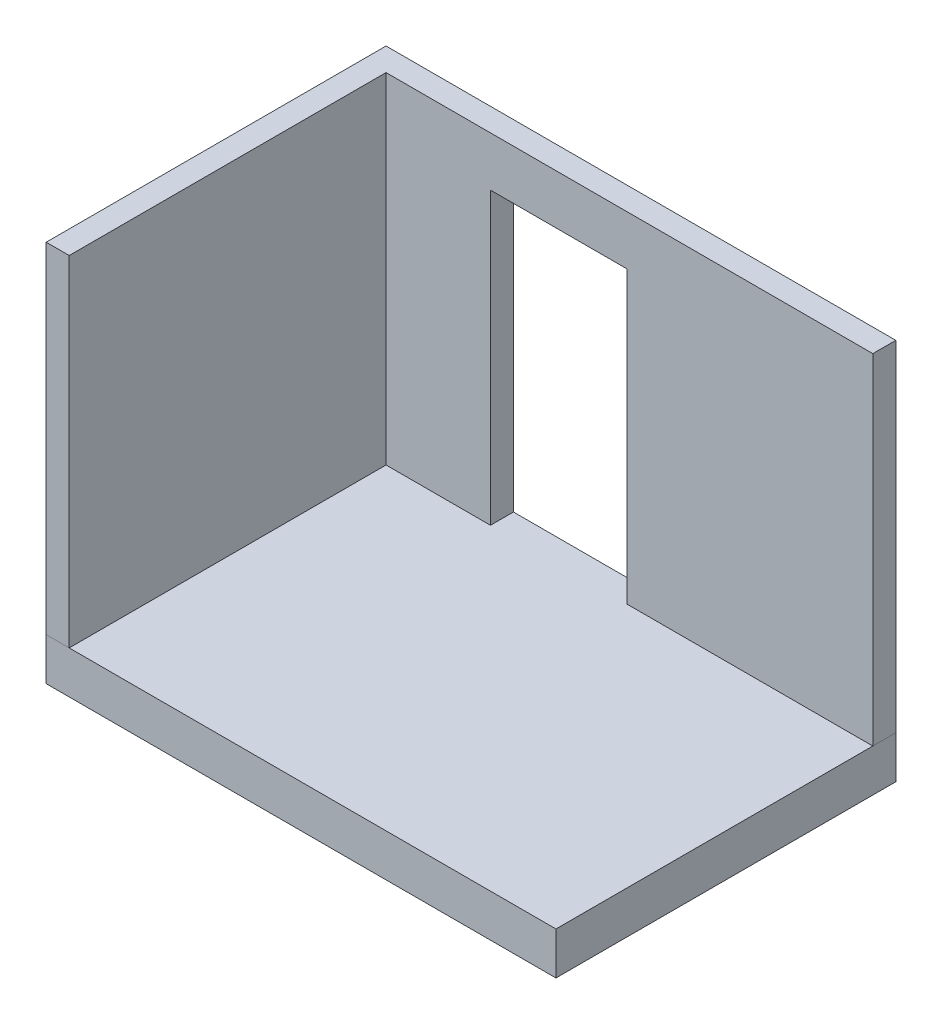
ISO-10303-21;
HEADER;
FILE_DESCRIPTION(('STEP AP214'),'2;1');
FILE_NAME('part.step','',(''),(''),'','','');
FILE_SCHEMA(('AUTOMOTIVE_DESIGN { 1 0 10303 214 1 1 1 1 }'));
ENDSEC;
DATA;
#1=APPLICATION_CONTEXT('core data for automotive mechanical design processes');
#2=APPLICATION_PROTOCOL_DEFINITION('international standard','automotive_design',2000,#1);
#3=PRODUCT_CONTEXT('',#1,'mechanical');
#4=PRODUCT('Part','Part','',(#3));
#5=PRODUCT_RELATED_PRODUCT_CATEGORY('part','',(#4));
#6=PRODUCT_DEFINITION_FORMATION('','',#4);
#7=PRODUCT_DEFINITION_CONTEXT('part definition',#1,'design');
#8=PRODUCT_DEFINITION('design','',#6,#7);
#9=PRODUCT_DEFINITION_SHAPE('','',#8);
#10=(LENGTH_UNIT() NAMED_UNIT(*) SI_UNIT(.MILLI.,.METRE.));
#11=(NAMED_UNIT(*) PLANE_ANGLE_UNIT() SI_UNIT($,.RADIAN.));
#12=(NAMED_UNIT(*) SI_UNIT($,.STERADIAN.) SOLID_ANGLE_UNIT());
#13=UNCERTAINTY_MEASURE_WITH_UNIT(LENGTH_MEASURE(1.E-05),#10,'distance_accuracy_value','');
#14=(GEOMETRIC_REPRESENTATION_CONTEXT(3) GLOBAL_UNCERTAINTY_ASSIGNED_CONTEXT((#13)) GLOBAL_UNIT_ASSIGNED_CONTEXT((#10,
#11,#12)) REPRESENTATION_CONTEXT('',''));
#15=CARTESIAN_POINT('',(0.,0.,0.));
#16=DIRECTION('',(0.,0.,1.));
#17=DIRECTION('',(1.,0.,0.));
#18=AXIS2_PLACEMENT_3D('',#15,#16,#17);
#19=CARTESIAN_POINT('',(0.,0.,0.));
#20=DIRECTION('',(0.,1.,0.));
#21=DIRECTION('',(0.,0.,1.));
#22=AXIS2_PLACEMENT_3D('',#19,#20,#21);
#23=PLANE('',#22);
#24=DIRECTION('',(1.,0.,0.));
#25=VECTOR('',#24,1.);
#26=CARTESIAN_POINT('',(3657.6,0.,165.1));
#27=LINE('',#26,#25);
#28=CARTESIAN_POINT('',(1892.3,0.,165.100000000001));
#29=VERTEX_POINT('',#28);
#30=CARTESIAN_POINT('',(3657.6,0.,165.1));
#31=VERTEX_POINT('',#30);
#32=EDGE_CURVE('E152',#29,#31,#27,.T.);
#33=ORIENTED_EDGE('',*,*,#32,.F.);
#34=DIRECTION('',(0.,0.,-1.));
#35=VECTOR('',#34,1.);
#36=CARTESIAN_POINT('',(1892.3,0.,0.));
#37=LINE('',#36,#35);
#38=CARTESIAN_POINT('',(1892.3,0.,0.));
#39=VERTEX_POINT('',#38);
#40=EDGE_CURVE('E53',#29,#39,#37,.T.);
#41=ORIENTED_EDGE('',*,*,#40,.T.);
#42=DIRECTION('',(-1.,0.,0.));
#43=VECTOR('',#42,1.);
#44=CARTESIAN_POINT('',(3657.6,0.,0.));
#45=LINE('',#44,#43);
#46=CARTESIAN_POINT('',(3657.6,0.,0.));
#47=VERTEX_POINT('',#46);
#48=EDGE_CURVE('E143',#47,#39,#45,.T.);
#49=ORIENTED_EDGE('',*,*,#48,.F.);
#50=DIRECTION('',(0.,0.,-1.));
#51=VECTOR('',#50,1.);
#52=CARTESIAN_POINT('',(3657.6,0.,165.1));
#53=LINE('',#52,#51);
#54=EDGE_CURVE('E96',#31,#47,#53,.T.);
#55=ORIENTED_EDGE('',*,*,#54,.F.);
#56=EDGE_LOOP('',(#33,#41,#49,#55));
#57=FACE_BOUND('',#56,.T.);
#58=ADVANCED_FACE('F45',(#57),#23,.F.);
#59=CARTESIAN_POINT('',(3657.6,2438.4,0.));
#60=DIRECTION('',(0.,0.,1.));
#61=DIRECTION('',(1.,0.,0.));
#62=AXIS2_PLACEMENT_3D('',#59,#60,#61);
#63=PLANE('',#62);
#64=ORIENTED_EDGE('',*,*,#48,.T.);
#65=DIRECTION('',(0.,-1.,0.));
#66=VECTOR('',#65,1.);
#67=CARTESIAN_POINT('',(1892.3,0.,0.));
#68=LINE('',#67,#66);
#69=CARTESIAN_POINT('',(1892.3,2082.8,0.));
#70=VERTEX_POINT('',#69);
#71=EDGE_CURVE('E182',#70,#39,#68,.T.);
#72=ORIENTED_EDGE('',*,*,#71,.F.);
#73=DIRECTION('',(1.,0.,0.));
#74=VECTOR('',#73,1.);
#75=CARTESIAN_POINT('',(1892.3,2082.8,0.));
#76=LINE('',#75,#74);
#77=CARTESIAN_POINT('',(914.4,2082.8,0.));
#78=VERTEX_POINT('',#77);
#79=EDGE_CURVE('E237',#78,#70,#76,.T.);
#80=ORIENTED_EDGE('',*,*,#79,.F.);
#81=DIRECTION('',(0.,1.,0.));
#82=VECTOR('',#81,1.);
#83=CARTESIAN_POINT('',(914.4,0.,0.));
#84=LINE('',#83,#82);
#85=CARTESIAN_POINT('',(914.4,0.,0.));
#86=VERTEX_POINT('',#85);
#87=EDGE_CURVE('E238',#86,#78,#84,.T.);
#88=ORIENTED_EDGE('',*,*,#87,.F.);
#89=CARTESIAN_POINT('',(0.,0.,0.));
#90=VERTEX_POINT('',#89);
#91=EDGE_CURVE('E147',#86,#90,#45,.T.);
#92=ORIENTED_EDGE('',*,*,#91,.T.);
#93=DIRECTION('',(0.,-1.,0.));
#94=VECTOR('',#93,1.);
#95=CARTESIAN_POINT('',(0.,2438.4,0.));
#96=LINE('',#95,#94);
#97=CARTESIAN_POINT('',(0.,2438.4,0.));
#98=VERTEX_POINT('',#97);
#99=EDGE_CURVE('E163',#98,#90,#96,.T.);
#100=ORIENTED_EDGE('',*,*,#99,.F.);
#101=DIRECTION('',(-1.,0.,0.));
#102=VECTOR('',#101,1.);
#103=CARTESIAN_POINT('',(3657.6,2438.4,0.));
#104=LINE('',#103,#102);
#105=CARTESIAN_POINT('',(3657.6,2438.4,0.));
#106=VERTEX_POINT('',#105);
#107=EDGE_CURVE('E156',#106,#98,#104,.T.);
#108=ORIENTED_EDGE('',*,*,#107,.F.);
#109=DIRECTION('',(0.,-1.,0.));
#110=VECTOR('',#109,1.);
#111=CARTESIAN_POINT('',(3657.6,2438.4,0.));
#112=LINE('',#111,#110);
#113=EDGE_CURVE('E139',#106,#47,#112,.T.);
#114=ORIENTED_EDGE('',*,*,#113,.T.);
#115=EDGE_LOOP('',(#64,#72,#80,#88,#92,#100,#108,#114));
#116=FACE_BOUND('',#115,.T.);
#117=ADVANCED_FACE('F47',(#116),#63,.F.);
#118=CARTESIAN_POINT('',(0.,2438.4,0.));
#119=DIRECTION('',(1.,0.,0.));
#120=DIRECTION('',(0.,0.,-1.));
#121=AXIS2_PLACEMENT_3D('',#118,#119,#120);
#122=PLANE('',#121);
#123=DIRECTION('',(0.,0.,1.));
#124=VECTOR('',#123,1.);
#125=CARTESIAN_POINT('',(0.,0.,0.));
#126=LINE('',#125,#124);
#127=CARTESIAN_POINT('',(2.98617875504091E-13,0.,2438.4));
#128=VERTEX_POINT('',#127);
#129=EDGE_CURVE('E146',#90,#128,#126,.T.);
#130=ORIENTED_EDGE('',*,*,#129,.T.);
#131=DIRECTION('',(0.,-1.,0.));
#132=VECTOR('',#131,1.);
#133=CARTESIAN_POINT('',(2.98617875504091E-13,2438.4,2438.4));
#134=LINE('',#133,#132);
#135=CARTESIAN_POINT('',(2.98617875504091E-13,2438.4,2438.4));
#136=VERTEX_POINT('',#135);
#137=EDGE_CURVE('E160',#136,#128,#134,.T.);
#138=ORIENTED_EDGE('',*,*,#137,.F.);
#139=DIRECTION('',(0.,0.,1.));
#140=VECTOR('',#139,1.);
#141=CARTESIAN_POINT('',(0.,2438.4,0.));
#142=LINE('',#141,#140);
#143=EDGE_CURVE('E105',#98,#136,#142,.T.);
#144=ORIENTED_EDGE('',*,*,#143,.F.);
#145=ORIENTED_EDGE('',*,*,#99,.T.);
#146=EDGE_LOOP('',(#130,#138,#144,#145));
#147=FACE_BOUND('',#146,.T.);
#148=ADVANCED_FACE('F200',(#147),#122,.F.);
#149=CARTESIAN_POINT('',(2.98617875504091E-13,2438.4,2438.4));
#150=DIRECTION('',(0.,0.,-1.));
#151=DIRECTION('',(-1.,0.,0.));
#152=AXIS2_PLACEMENT_3D('',#149,#150,#151);
#153=PLANE('',#152);
#154=DIRECTION('',(1.,0.,0.));
#155=VECTOR('',#154,1.);
#156=CARTESIAN_POINT('',(2.98617875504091E-13,0.,2438.4));
#157=LINE('',#156,#155);
#158=CARTESIAN_POINT('',(165.1,0.,2438.4));
#159=VERTEX_POINT('',#158);
#160=EDGE_CURVE('E149',#128,#159,#157,.T.);
#161=ORIENTED_EDGE('',*,*,#160,.T.);
#162=DIRECTION('',(0.,-1.,0.));
#163=VECTOR('',#162,1.);
#164=CARTESIAN_POINT('',(165.1,2438.4,2438.4));
#165=LINE('',#164,#163);
#166=CARTESIAN_POINT('',(165.1,2438.4,2438.4));
#167=VERTEX_POINT('',#166);
#168=EDGE_CURVE('E134',#167,#159,#165,.T.);
#169=ORIENTED_EDGE('',*,*,#168,.F.);
#170=DIRECTION('',(1.,0.,0.));
#171=VECTOR('',#170,1.);
#172=CARTESIAN_POINT('',(2.98617875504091E-13,2438.4,2438.4));
#173=LINE('',#172,#171);
#174=EDGE_CURVE('E121',#136,#167,#173,.T.);
#175=ORIENTED_EDGE('',*,*,#174,.F.);
#176=ORIENTED_EDGE('',*,*,#137,.T.);
#177=EDGE_LOOP('',(#161,#169,#175,#176));
#178=FACE_BOUND('',#177,.T.);
#179=ADVANCED_FACE('F224',(#178),#153,.F.);
#180=CARTESIAN_POINT('',(165.1,2438.4,165.1));
#181=DIRECTION('',(-1.,0.,0.));
#182=DIRECTION('',(0.,0.,1.));
#183=AXIS2_PLACEMENT_3D('',#180,#181,#182);
#184=PLANE('',#183);
#185=DIRECTION('',(0.,0.,-1.));
#186=VECTOR('',#185,1.);
#187=CARTESIAN_POINT('',(165.1,0.,165.1));
#188=LINE('',#187,#186);
#189=CARTESIAN_POINT('',(165.1,0.,165.1));
#190=VERTEX_POINT('',#189);
#191=EDGE_CURVE('E130',#159,#190,#188,.T.);
#192=ORIENTED_EDGE('',*,*,#191,.T.);
#193=DIRECTION('',(0.,-1.,0.));
#194=VECTOR('',#193,1.);
#195=CARTESIAN_POINT('',(165.1,2438.4,165.1));
#196=LINE('',#195,#194);
#197=CARTESIAN_POINT('',(165.1,2438.4,165.1));
#198=VERTEX_POINT('',#197);
#199=EDGE_CURVE('E127',#198,#190,#196,.T.);
#200=ORIENTED_EDGE('',*,*,#199,.F.);
#201=DIRECTION('',(0.,0.,-1.));
#202=VECTOR('',#201,1.);
#203=CARTESIAN_POINT('',(165.1,2438.4,165.1));
#204=LINE('',#203,#202);
#205=EDGE_CURVE('E114',#167,#198,#204,.T.);
#206=ORIENTED_EDGE('',*,*,#205,.F.);
#207=ORIENTED_EDGE('',*,*,#168,.T.);
#208=EDGE_LOOP('',(#192,#200,#206,#207));
#209=FACE_BOUND('',#208,.T.);
#210=ADVANCED_FACE('F128',(#209),#184,.F.);
#211=CARTESIAN_POINT('',(3657.6,2438.4,165.1));
#212=DIRECTION('',(0.,0.,-1.));
#213=DIRECTION('',(-1.,0.,0.));
#214=AXIS2_PLACEMENT_3D('',#211,#212,#213);
#215=PLANE('',#214);
#216=DIRECTION('',(1.,0.,0.));
#217=VECTOR('',#216,1.);
#218=CARTESIAN_POINT('',(3657.6,2082.8,165.1));
#219=LINE('',#218,#217);
#220=CARTESIAN_POINT('',(914.4,2082.8,165.100000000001));
#221=VERTEX_POINT('',#220);
#222=CARTESIAN_POINT('',(1892.3,2082.8,165.100000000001));
#223=VERTEX_POINT('',#222);
#224=EDGE_CURVE('E12',#221,#223,#219,.T.);
#225=ORIENTED_EDGE('',*,*,#224,.T.);
#226=DIRECTION('',(0.,-1.,0.));
#227=VECTOR('',#226,1.);
#228=CARTESIAN_POINT('',(1892.3,2438.4,165.1));
#229=LINE('',#228,#227);
#230=EDGE_CURVE('E216',#223,#29,#229,.T.);
#231=ORIENTED_EDGE('',*,*,#230,.T.);
#232=ORIENTED_EDGE('',*,*,#32,.T.);
#233=DIRECTION('',(0.,-1.,0.));
#234=VECTOR('',#233,1.);
#235=CARTESIAN_POINT('',(3657.6,2438.4,165.1));
#236=LINE('',#235,#234);
#237=CARTESIAN_POINT('',(3657.6,2438.4,165.1));
#238=VERTEX_POINT('',#237);
#239=EDGE_CURVE('E135',#238,#31,#236,.T.);
#240=ORIENTED_EDGE('',*,*,#239,.F.);
#241=DIRECTION('',(1.,0.,0.));
#242=VECTOR('',#241,1.);
#243=CARTESIAN_POINT('',(3657.6,2438.4,165.1));
#244=LINE('',#243,#242);
#245=EDGE_CURVE('E118',#198,#238,#244,.T.);
#246=ORIENTED_EDGE('',*,*,#245,.F.);
#247=ORIENTED_EDGE('',*,*,#199,.T.);
#248=CARTESIAN_POINT('',(914.4,0.,165.1));
#249=VERTEX_POINT('',#248);
#250=EDGE_CURVE('E153',#190,#249,#27,.T.);
#251=ORIENTED_EDGE('',*,*,#250,.T.);
#252=DIRECTION('',(0.,1.,0.));
#253=VECTOR('',#252,1.);
#254=CARTESIAN_POINT('',(914.400000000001,2438.4,165.1));
#255=LINE('',#254,#253);
#256=EDGE_CURVE('E60',#249,#221,#255,.T.);
#257=ORIENTED_EDGE('',*,*,#256,.T.);
#258=EDGE_LOOP('',(#225,#231,#232,#240,#246,#247,#251,#257));
#259=FACE_BOUND('',#258,.T.);
#260=ADVANCED_FACE('F137',(#259),#215,.F.);
#261=CARTESIAN_POINT('',(3657.6,2438.4,165.1));
#262=DIRECTION('',(-1.,0.,0.));
#263=DIRECTION('',(0.,0.,1.));
#264=AXIS2_PLACEMENT_3D('',#261,#262,#263);
#265=PLANE('',#264);
#266=ORIENTED_EDGE('',*,*,#54,.T.);
#267=ORIENTED_EDGE('',*,*,#113,.F.);
#268=DIRECTION('',(0.,0.,-1.));
#269=VECTOR('',#268,1.);
#270=CARTESIAN_POINT('',(3657.6,2438.4,165.1));
#271=LINE('',#270,#269);
#272=EDGE_CURVE('E69',#238,#106,#271,.T.);
#273=ORIENTED_EDGE('',*,*,#272,.F.);
#274=ORIENTED_EDGE('',*,*,#239,.T.);
#275=EDGE_LOOP('',(#266,#267,#273,#274));
#276=FACE_BOUND('',#275,.T.);
#277=ADVANCED_FACE('F185',(#276),#265,.F.);
#278=CARTESIAN_POINT('',(0.,2438.4,0.));
#279=DIRECTION('',(0.,1.,0.));
#280=DIRECTION('',(0.,0.,1.));
#281=AXIS2_PLACEMENT_3D('',#278,#279,#280);
#282=PLANE('',#281);
#283=ORIENTED_EDGE('',*,*,#107,.T.);
#284=ORIENTED_EDGE('',*,*,#143,.T.);
#285=ORIENTED_EDGE('',*,*,#174,.T.);
#286=ORIENTED_EDGE('',*,*,#205,.T.);
#287=ORIENTED_EDGE('',*,*,#245,.T.);
#288=ORIENTED_EDGE('',*,*,#272,.T.);
#289=EDGE_LOOP('',(#283,#284,#285,#286,#287,#288));
#290=FACE_BOUND('',#289,.T.);
#291=ADVANCED_FACE('F116',(#290),#282,.T.);
#292=ORIENTED_EDGE('',*,*,#91,.F.);
#293=DIRECTION('',(0.,0.,1.));
#294=VECTOR('',#293,1.);
#295=CARTESIAN_POINT('',(914.4,0.,0.));
#296=LINE('',#295,#294);
#297=EDGE_CURVE('E165',#86,#249,#296,.T.);
#298=ORIENTED_EDGE('',*,*,#297,.T.);
#299=ORIENTED_EDGE('',*,*,#250,.F.);
#300=ORIENTED_EDGE('',*,*,#191,.F.);
#301=ORIENTED_EDGE('',*,*,#160,.F.);
#302=ORIENTED_EDGE('',*,*,#129,.F.);
#303=EDGE_LOOP('',(#292,#298,#299,#300,#301,#302));
#304=FACE_BOUND('',#303,.T.);
#305=ADVANCED_FACE('F192',(#304),#23,.F.);
#306=CARTESIAN_POINT('',(1892.3,2082.8,2438.4));
#307=DIRECTION('',(0.,1.,0.));
#308=DIRECTION('',(0.,0.,1.));
#309=AXIS2_PLACEMENT_3D('',#306,#307,#308);
#310=PLANE('',#309);
#311=DIRECTION('',(0.,0.,-1.));
#312=VECTOR('',#311,1.);
#313=CARTESIAN_POINT('',(914.4,2082.8,2438.4));
#314=LINE('',#313,#312);
#315=EDGE_CURVE('E235',#221,#78,#314,.T.);
#316=ORIENTED_EDGE('',*,*,#315,.T.);
#317=ORIENTED_EDGE('',*,*,#79,.T.);
#318=DIRECTION('',(0.,0.,-1.));
#319=VECTOR('',#318,1.);
#320=CARTESIAN_POINT('',(1892.3,2082.8,2438.4));
#321=LINE('',#320,#319);
#322=EDGE_CURVE('E218',#223,#70,#321,.T.);
#323=ORIENTED_EDGE('',*,*,#322,.F.);
#324=ORIENTED_EDGE('',*,*,#224,.F.);
#325=EDGE_LOOP('',(#316,#317,#323,#324));
#326=FACE_BOUND('',#325,.T.);
#327=ADVANCED_FACE('F202',(#326),#310,.F.);
#328=CARTESIAN_POINT('',(1892.3,0.,2438.4));
#329=DIRECTION('',(1.,0.,0.));
#330=DIRECTION('',(0.,0.,-1.));
#331=AXIS2_PLACEMENT_3D('',#328,#329,#330);
#332=PLANE('',#331);
#333=ORIENTED_EDGE('',*,*,#322,.T.);
#334=ORIENTED_EDGE('',*,*,#71,.T.);
#335=ORIENTED_EDGE('',*,*,#40,.F.);
#336=ORIENTED_EDGE('',*,*,#230,.F.);
#337=EDGE_LOOP('',(#333,#334,#335,#336));
#338=FACE_BOUND('',#337,.T.);
#339=ADVANCED_FACE('F207',(#338),#332,.F.);
#340=CARTESIAN_POINT('',(914.4,0.,2438.4));
#341=DIRECTION('',(-1.,0.,0.));
#342=DIRECTION('',(0.,0.,1.));
#343=AXIS2_PLACEMENT_3D('',#340,#341,#342);
#344=PLANE('',#343);
#345=ORIENTED_EDGE('',*,*,#297,.F.);
#346=ORIENTED_EDGE('',*,*,#87,.T.);
#347=ORIENTED_EDGE('',*,*,#315,.F.);
#348=ORIENTED_EDGE('',*,*,#256,.F.);
#349=EDGE_LOOP('',(#345,#346,#347,#348));
#350=FACE_BOUND('',#349,.T.);
#351=ADVANCED_FACE('F239',(#350),#344,.F.);
#352=CLOSED_SHELL('',(#58,#117,#148,#179,#210,#260,#277,#291,#305,#327,#339,#351));
#353=MANIFOLD_SOLID_BREP('B2',#352);
#354=CARTESIAN_POINT('',(0.,-304.8,0.));
#355=DIRECTION('',(-1.,0.,0.));
#356=DIRECTION('',(0.,0.,1.));
#357=AXIS2_PLACEMENT_3D('',#354,#355,#356);
#358=PLANE('',#357);
#359=DIRECTION('',(0.,0.,1.));
#360=VECTOR('',#359,1.);
#361=CARTESIAN_POINT('',(0.,0.,0.));
#362=LINE('',#361,#360);
#363=CARTESIAN_POINT('',(0.,0.,0.));
#364=VERTEX_POINT('',#363);
#365=CARTESIAN_POINT('',(2.98617875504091E-13,0.,2438.4));
#366=VERTEX_POINT('',#365);
#367=EDGE_CURVE('E386',#364,#366,#362,.T.);
#368=ORIENTED_EDGE('',*,*,#367,.F.);
#369=DIRECTION('',(0.,1.,0.));
#370=VECTOR('',#369,1.);
#371=CARTESIAN_POINT('',(0.,-304.8,0.));
#372=LINE('',#371,#370);
#373=CARTESIAN_POINT('',(0.,-304.8,0.));
#374=VERTEX_POINT('',#373);
#375=EDGE_CURVE('E43',#374,#364,#372,.T.);
#376=ORIENTED_EDGE('',*,*,#375,.F.);
#377=DIRECTION('',(0.,0.,1.));
#378=VECTOR('',#377,1.);
#379=CARTESIAN_POINT('',(0.,-304.8,0.));
#380=LINE('',#379,#378);
#381=CARTESIAN_POINT('',(2.98617875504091E-13,-304.8,2438.4));
#382=VERTEX_POINT('',#381);
#383=EDGE_CURVE('E380',#374,#382,#380,.T.);
#384=ORIENTED_EDGE('',*,*,#383,.T.);
#385=DIRECTION('',(0.,1.,0.));
#386=VECTOR('',#385,1.);
#387=CARTESIAN_POINT('',(2.98617875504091E-13,-304.8,2438.4));
#388=LINE('',#387,#386);
#389=EDGE_CURVE('E325',#382,#366,#388,.T.);
#390=ORIENTED_EDGE('',*,*,#389,.T.);
#391=EDGE_LOOP('',(#368,#376,#384,#390));
#392=FACE_BOUND('',#391,.T.);
#393=ADVANCED_FACE('F322',(#392),#358,.T.);
#394=CARTESIAN_POINT('',(0.,-304.8,0.));
#395=DIRECTION('',(0.,0.,-1.));
#396=DIRECTION('',(-1.,0.,0.));
#397=AXIS2_PLACEMENT_3D('',#394,#395,#396);
#398=PLANE('',#397);
#399=DIRECTION('',(-1.,0.,0.));
#400=VECTOR('',#399,1.);
#401=CARTESIAN_POINT('',(0.,0.,0.));
#402=LINE('',#401,#400);
#403=CARTESIAN_POINT('',(3657.6,0.,0.));
#404=VERTEX_POINT('',#403);
#405=EDGE_CURVE('E382',#404,#364,#402,.T.);
#406=ORIENTED_EDGE('',*,*,#405,.F.);
#407=DIRECTION('',(0.,1.,0.));
#408=VECTOR('',#407,1.);
#409=CARTESIAN_POINT('',(3657.6,-304.8,0.));
#410=LINE('',#409,#408);
#411=CARTESIAN_POINT('',(3657.6,-304.8,0.));
#412=VERTEX_POINT('',#411);
#413=EDGE_CURVE('E331',#412,#404,#410,.T.);
#414=ORIENTED_EDGE('',*,*,#413,.F.);
#415=DIRECTION('',(-1.,0.,0.));
#416=VECTOR('',#415,1.);
#417=CARTESIAN_POINT('',(0.,-304.8,0.));
#418=LINE('',#417,#416);
#419=EDGE_CURVE('E377',#412,#374,#418,.T.);
#420=ORIENTED_EDGE('',*,*,#419,.T.);
#421=ORIENTED_EDGE('',*,*,#375,.T.);
#422=EDGE_LOOP('',(#406,#414,#420,#421));
#423=FACE_BOUND('',#422,.T.);
#424=ADVANCED_FACE('F396',(#423),#398,.T.);
#425=CARTESIAN_POINT('',(3657.6,-304.8,0.));
#426=DIRECTION('',(1.,0.,0.));
#427=DIRECTION('',(0.,0.,-1.));
#428=AXIS2_PLACEMENT_3D('',#425,#426,#427);
#429=PLANE('',#428);
#430=DIRECTION('',(0.,0.,-1.));
#431=VECTOR('',#430,1.);
#432=CARTESIAN_POINT('',(3657.6,0.,0.));
#433=LINE('',#432,#431);
#434=CARTESIAN_POINT('',(3657.6,0.,2438.4));
#435=VERTEX_POINT('',#434);
#436=EDGE_CURVE('E372',#435,#404,#433,.T.);
#437=ORIENTED_EDGE('',*,*,#436,.F.);
#438=DIRECTION('',(0.,1.,0.));
#439=VECTOR('',#438,1.);
#440=CARTESIAN_POINT('',(3657.6,-304.8,2438.4));
#441=LINE('',#440,#439);
#442=CARTESIAN_POINT('',(3657.6,-304.8,2438.4));
#443=VERTEX_POINT('',#442);
#444=EDGE_CURVE('E367',#443,#435,#441,.T.);
#445=ORIENTED_EDGE('',*,*,#444,.F.);
#446=DIRECTION('',(0.,0.,-1.));
#447=VECTOR('',#446,1.);
#448=CARTESIAN_POINT('',(3657.6,-304.8,0.));
#449=LINE('',#448,#447);
#450=EDGE_CURVE('E370',#443,#412,#449,.T.);
#451=ORIENTED_EDGE('',*,*,#450,.T.);
#452=ORIENTED_EDGE('',*,*,#413,.T.);
#453=EDGE_LOOP('',(#437,#445,#451,#452));
#454=FACE_BOUND('',#453,.T.);
#455=ADVANCED_FACE('F369',(#454),#429,.T.);
#456=CARTESIAN_POINT('',(2.98617875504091E-13,-304.8,2438.4));
#457=DIRECTION('',(0.,0.,1.));
#458=DIRECTION('',(1.,0.,0.));
#459=AXIS2_PLACEMENT_3D('',#456,#457,#458);
#460=PLANE('',#459);
#461=DIRECTION('',(1.,0.,0.));
#462=VECTOR('',#461,1.);
#463=CARTESIAN_POINT('',(2.98617875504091E-13,0.,2438.4));
#464=LINE('',#463,#462);
#465=EDGE_CURVE('E389',#366,#435,#464,.T.);
#466=ORIENTED_EDGE('',*,*,#465,.F.);
#467=ORIENTED_EDGE('',*,*,#389,.F.);
#468=DIRECTION('',(1.,0.,0.));
#469=VECTOR('',#468,1.);
#470=CARTESIAN_POINT('',(2.98617875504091E-13,-304.8,2438.4));
#471=LINE('',#470,#469);
#472=EDGE_CURVE('E376',#382,#443,#471,.T.);
#473=ORIENTED_EDGE('',*,*,#472,.T.);
#474=ORIENTED_EDGE('',*,*,#444,.T.);
#475=EDGE_LOOP('',(#466,#467,#473,#474));
#476=FACE_BOUND('',#475,.T.);
#477=ADVANCED_FACE('F379',(#476),#460,.T.);
#478=CARTESIAN_POINT('',(2.98617875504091E-13,-304.8,2438.4));
#479=DIRECTION('',(0.,1.,0.));
#480=DIRECTION('',(0.,0.,1.));
#481=AXIS2_PLACEMENT_3D('',#478,#479,#480);
#482=PLANE('',#481);
#483=ORIENTED_EDGE('',*,*,#383,.F.);
#484=ORIENTED_EDGE('',*,*,#419,.F.);
#485=ORIENTED_EDGE('',*,*,#450,.F.);
#486=ORIENTED_EDGE('',*,*,#472,.F.);
#487=EDGE_LOOP('',(#483,#484,#485,#486));
#488=FACE_BOUND('',#487,.T.);
#489=ADVANCED_FACE('F375',(#488),#482,.F.);
#490=CARTESIAN_POINT('',(2.98617875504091E-13,0.,2438.4));
#491=DIRECTION('',(0.,1.,0.));
#492=DIRECTION('',(0.,0.,1.));
#493=AXIS2_PLACEMENT_3D('',#490,#491,#492);
#494=PLANE('',#493);
#495=ORIENTED_EDGE('',*,*,#367,.T.);
#496=ORIENTED_EDGE('',*,*,#465,.T.);
#497=ORIENTED_EDGE('',*,*,#436,.T.);
#498=ORIENTED_EDGE('',*,*,#405,.T.);
#499=EDGE_LOOP('',(#495,#496,#497,#498));
#500=FACE_BOUND('',#499,.T.);
#501=ADVANCED_FACE('F395',(#500),#494,.T.);
#502=CLOSED_SHELL('',(#393,#424,#455,#477,#489,#501));
#503=MANIFOLD_SOLID_BREP('B6',#502);
#504=ADVANCED_BREP_SHAPE_REPRESENTATION('',(#18,#353,#503),#14);
#505=SHAPE_DEFINITION_REPRESENTATION(#9,#504);
ENDSEC;
END-ISO-10303-21;
